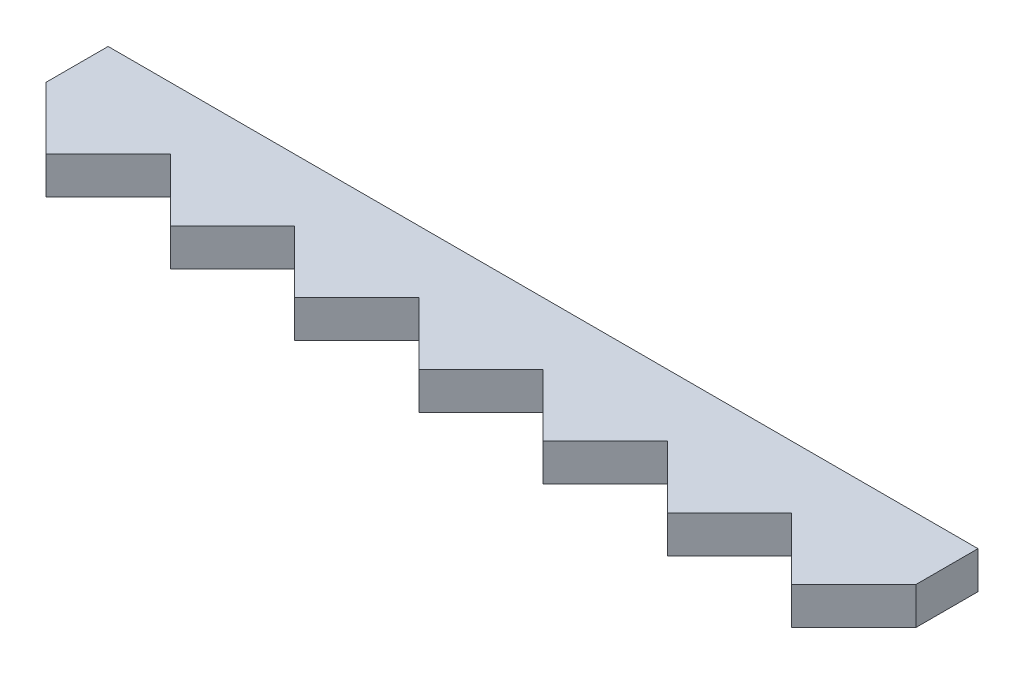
from build123d import *

# Parameters (mm, degrees)
BOSS_EXTRUDE1_DEPTH = 3


with BuildPart() as part:
    # Sketch1 → Boss-Extrude1 (new body)
    with BuildSketch(Plane(origin=(0, 3, 0), x_dir=(1, 0, 0), z_dir=(0, 1, 0))):
        Polygon((0, 32.140403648), (0, 27.140403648), (5, 22.140403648), (10, 27.140403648), (15, 22.140403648), (20, 27.140403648), (25, 22.140403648), (30, 27.140403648), (35, 22.140403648), (40, 27.140403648), (45, 22.140403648), (50, 27.140403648), (55, 22.140403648), (60, 27.140403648), (65, 22.140403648), (70, 27.140403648), (70, 32.140403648), align=None)
    extrude(amount=BOSS_EXTRUDE1_DEPTH)


solid = part.part
